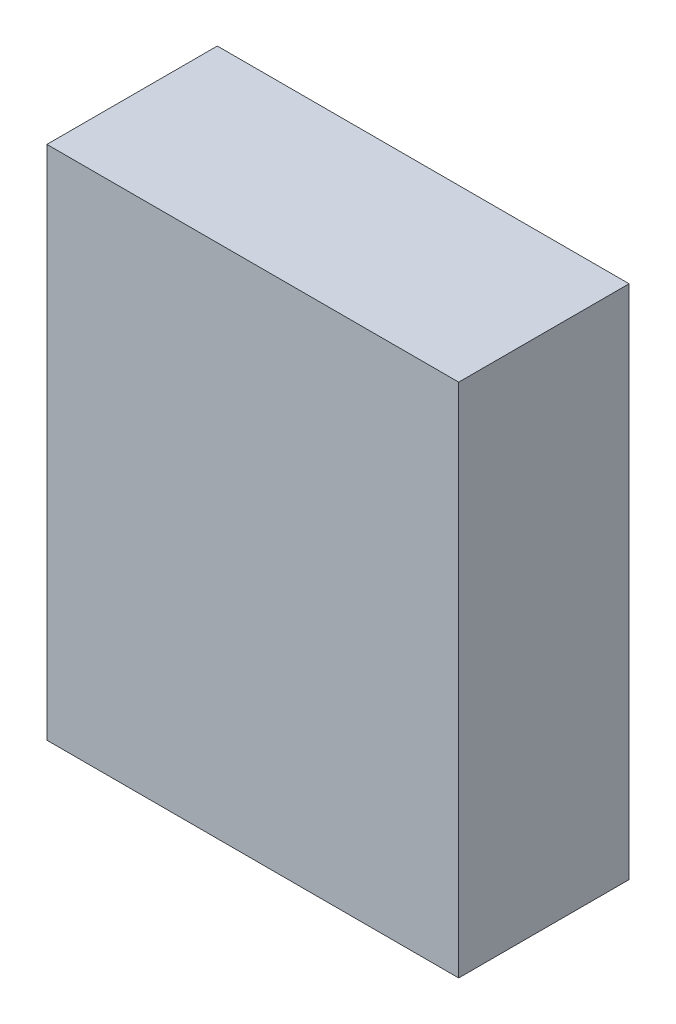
ISO-10303-21;
HEADER;
FILE_DESCRIPTION(('STEP AP214'),'2;1');
FILE_NAME('part.step','',(''),(''),'','','');
FILE_SCHEMA(('AUTOMOTIVE_DESIGN { 1 0 10303 214 1 1 1 1 }'));
ENDSEC;
DATA;
#1=APPLICATION_CONTEXT('core data for automotive mechanical design processes');
#2=APPLICATION_PROTOCOL_DEFINITION('international standard','automotive_design',2000,#1);
#3=PRODUCT_CONTEXT('',#1,'mechanical');
#4=PRODUCT('Part','Part','',(#3));
#5=PRODUCT_RELATED_PRODUCT_CATEGORY('part','',(#4));
#6=PRODUCT_DEFINITION_FORMATION('','',#4);
#7=PRODUCT_DEFINITION_CONTEXT('part definition',#1,'design');
#8=PRODUCT_DEFINITION('design','',#6,#7);
#9=PRODUCT_DEFINITION_SHAPE('','',#8);
#10=(LENGTH_UNIT() NAMED_UNIT(*) SI_UNIT(.MILLI.,.METRE.));
#11=(NAMED_UNIT(*) PLANE_ANGLE_UNIT() SI_UNIT($,.RADIAN.));
#12=(NAMED_UNIT(*) SI_UNIT($,.STERADIAN.) SOLID_ANGLE_UNIT());
#13=UNCERTAINTY_MEASURE_WITH_UNIT(LENGTH_MEASURE(1.E-05),#10,'distance_accuracy_value','');
#14=(GEOMETRIC_REPRESENTATION_CONTEXT(3) GLOBAL_UNCERTAINTY_ASSIGNED_CONTEXT((#13)) GLOBAL_UNIT_ASSIGNED_CONTEXT((#10,
#11,#12)) REPRESENTATION_CONTEXT('',''));
#15=CARTESIAN_POINT('',(0.,0.,0.));
#16=DIRECTION('',(0.,0.,1.));
#17=DIRECTION('',(1.,0.,0.));
#18=AXIS2_PLACEMENT_3D('',#15,#16,#17);
#19=CARTESIAN_POINT('',(1.99499982,-2.50000008,1.651));
#20=DIRECTION('',(0.,0.,-1.));
#21=DIRECTION('',(-1.,0.,0.));
#22=AXIS2_PLACEMENT_3D('',#19,#20,#21);
#23=PLANE('',#22);
#24=DIRECTION('',(1.,0.,0.));
#25=VECTOR('',#24,1.);
#26=CARTESIAN_POINT('',(1.99499982,2.50000008,1.651));
#27=LINE('',#26,#25);
#28=CARTESIAN_POINT('',(1.99499982,2.50000008,1.651));
#29=VERTEX_POINT('',#28);
#30=CARTESIAN_POINT('',(-1.99499982,2.50000008,1.651));
#31=VERTEX_POINT('',#30);
#32=EDGE_CURVE('E55',#29,#31,#27,.F.);
#33=ORIENTED_EDGE('',*,*,#32,.T.);
#34=DIRECTION('',(0.,1.,0.));
#35=VECTOR('',#34,1.);
#36=CARTESIAN_POINT('',(-1.99499982,2.50000008,1.651));
#37=LINE('',#36,#35);
#38=CARTESIAN_POINT('',(-1.99499982,-2.50000008,1.651));
#39=VERTEX_POINT('',#38);
#40=EDGE_CURVE('E57',#31,#39,#37,.F.);
#41=ORIENTED_EDGE('',*,*,#40,.T.);
#42=DIRECTION('',(1.,0.,0.));
#43=VECTOR('',#42,1.);
#44=CARTESIAN_POINT('',(-1.99499982,-2.50000008,1.651));
#45=LINE('',#44,#43);
#46=CARTESIAN_POINT('',(1.99499982,-2.50000008,1.651));
#47=VERTEX_POINT('',#46);
#48=EDGE_CURVE('E20',#39,#47,#45,.T.);
#49=ORIENTED_EDGE('',*,*,#48,.T.);
#50=DIRECTION('',(0.,1.,0.));
#51=VECTOR('',#50,1.);
#52=CARTESIAN_POINT('',(1.99499982,-2.50000008,1.651));
#53=LINE('',#52,#51);
#54=EDGE_CURVE('E80',#47,#29,#53,.T.);
#55=ORIENTED_EDGE('',*,*,#54,.T.);
#56=EDGE_LOOP('',(#33,#41,#49,#55));
#57=FACE_BOUND('',#56,.T.);
#58=ADVANCED_FACE('F17',(#57),#23,.F.);
#59=CARTESIAN_POINT('',(-1.99499982,-2.50000008,0.));
#60=DIRECTION('',(0.,1.,0.));
#61=DIRECTION('',(0.,0.,1.));
#62=AXIS2_PLACEMENT_3D('',#59,#60,#61);
#63=PLANE('',#62);
#64=DIRECTION('',(0.,0.,1.));
#65=VECTOR('',#64,1.);
#66=CARTESIAN_POINT('',(1.99499982,-2.50000008,0.));
#67=LINE('',#66,#65);
#68=CARTESIAN_POINT('',(1.99499982,-2.50000008,0.));
#69=VERTEX_POINT('',#68);
#70=EDGE_CURVE('E68',#69,#47,#67,.T.);
#71=ORIENTED_EDGE('',*,*,#70,.T.);
#72=ORIENTED_EDGE('',*,*,#48,.F.);
#73=DIRECTION('',(0.,0.,-1.));
#74=VECTOR('',#73,1.);
#75=CARTESIAN_POINT('',(-1.99499982,-2.50000008,0.));
#76=LINE('',#75,#74);
#77=CARTESIAN_POINT('',(-1.99499982,-2.50000008,0.));
#78=VERTEX_POINT('',#77);
#79=EDGE_CURVE('E63',#39,#78,#76,.T.);
#80=ORIENTED_EDGE('',*,*,#79,.T.);
#81=DIRECTION('',(-1.,0.,0.));
#82=VECTOR('',#81,1.);
#83=CARTESIAN_POINT('',(1.99499982,-2.50000008,0.));
#84=LINE('',#83,#82);
#85=EDGE_CURVE('E83',#69,#78,#84,.T.);
#86=ORIENTED_EDGE('',*,*,#85,.F.);
#87=EDGE_LOOP('',(#71,#72,#80,#86));
#88=FACE_BOUND('',#87,.T.);
#89=ADVANCED_FACE('F65',(#88),#63,.F.);
#90=CARTESIAN_POINT('',(-1.99499982,2.50000008,0.));
#91=DIRECTION('',(1.,0.,0.));
#92=DIRECTION('',(0.,0.,-1.));
#93=AXIS2_PLACEMENT_3D('',#90,#91,#92);
#94=PLANE('',#93);
#95=ORIENTED_EDGE('',*,*,#79,.F.);
#96=ORIENTED_EDGE('',*,*,#40,.F.);
#97=DIRECTION('',(0.,0.,-1.));
#98=VECTOR('',#97,1.);
#99=CARTESIAN_POINT('',(-1.99499982,2.50000008,0.));
#100=LINE('',#99,#98);
#101=CARTESIAN_POINT('',(-1.99499982,2.50000008,0.));
#102=VERTEX_POINT('',#101);
#103=EDGE_CURVE('E75',#31,#102,#100,.T.);
#104=ORIENTED_EDGE('',*,*,#103,.T.);
#105=DIRECTION('',(0.,1.,0.));
#106=VECTOR('',#105,1.);
#107=CARTESIAN_POINT('',(-1.99499982,-2.50000008,0.));
#108=LINE('',#107,#106);
#109=EDGE_CURVE('E72',#78,#102,#108,.T.);
#110=ORIENTED_EDGE('',*,*,#109,.F.);
#111=EDGE_LOOP('',(#95,#96,#104,#110));
#112=FACE_BOUND('',#111,.T.);
#113=ADVANCED_FACE('F70',(#112),#94,.F.);
#114=CARTESIAN_POINT('',(1.99499982,2.50000008,0.));
#115=DIRECTION('',(0.,-1.,0.));
#116=DIRECTION('',(0.,0.,-1.));
#117=AXIS2_PLACEMENT_3D('',#114,#115,#116);
#118=PLANE('',#117);
#119=ORIENTED_EDGE('',*,*,#103,.F.);
#120=ORIENTED_EDGE('',*,*,#32,.F.);
#121=DIRECTION('',(0.,0.,1.));
#122=VECTOR('',#121,1.);
#123=CARTESIAN_POINT('',(1.99499982,2.50000008,0.));
#124=LINE('',#123,#122);
#125=CARTESIAN_POINT('',(1.99499982,2.50000008,0.));
#126=VERTEX_POINT('',#125);
#127=EDGE_CURVE('E35',#29,#126,#124,.F.);
#128=ORIENTED_EDGE('',*,*,#127,.T.);
#129=DIRECTION('',(-1.,0.,0.));
#130=VECTOR('',#129,1.);
#131=CARTESIAN_POINT('',(1.99499982,2.50000008,0.));
#132=LINE('',#131,#130);
#133=EDGE_CURVE('E26',#102,#126,#132,.F.);
#134=ORIENTED_EDGE('',*,*,#133,.F.);
#135=EDGE_LOOP('',(#119,#120,#128,#134));
#136=FACE_BOUND('',#135,.T.);
#137=ADVANCED_FACE('F89',(#136),#118,.F.);
#138=CARTESIAN_POINT('',(1.99499982,-2.50000008,0.));
#139=DIRECTION('',(-1.,0.,0.));
#140=DIRECTION('',(0.,0.,1.));
#141=AXIS2_PLACEMENT_3D('',#138,#139,#140);
#142=PLANE('',#141);
#143=ORIENTED_EDGE('',*,*,#127,.F.);
#144=ORIENTED_EDGE('',*,*,#54,.F.);
#145=ORIENTED_EDGE('',*,*,#70,.F.);
#146=DIRECTION('',(0.,1.,0.));
#147=VECTOR('',#146,1.);
#148=CARTESIAN_POINT('',(1.99499982,-2.50000008,0.));
#149=LINE('',#148,#147);
#150=EDGE_CURVE('E11',#126,#69,#149,.F.);
#151=ORIENTED_EDGE('',*,*,#150,.F.);
#152=EDGE_LOOP('',(#143,#144,#145,#151));
#153=FACE_BOUND('',#152,.T.);
#154=ADVANCED_FACE('F91',(#153),#142,.F.);
#155=CARTESIAN_POINT('',(1.99499982,-2.50000008,0.));
#156=DIRECTION('',(0.,0.,-1.));
#157=DIRECTION('',(-1.,0.,0.));
#158=AXIS2_PLACEMENT_3D('',#155,#156,#157);
#159=PLANE('',#158);
#160=ORIENTED_EDGE('',*,*,#133,.T.);
#161=ORIENTED_EDGE('',*,*,#150,.T.);
#162=ORIENTED_EDGE('',*,*,#85,.T.);
#163=ORIENTED_EDGE('',*,*,#109,.T.);
#164=EDGE_LOOP('',(#160,#161,#162,#163));
#165=FACE_BOUND('',#164,.T.);
#166=ADVANCED_FACE('F88',(#165),#159,.T.);
#167=CLOSED_SHELL('',(#58,#89,#113,#137,#154,#166));
#168=MANIFOLD_SOLID_BREP('B1',#167);
#169=ADVANCED_BREP_SHAPE_REPRESENTATION('',(#18,#168),#14);
#170=SHAPE_DEFINITION_REPRESENTATION(#9,#169);
ENDSEC;
END-ISO-10303-21;
